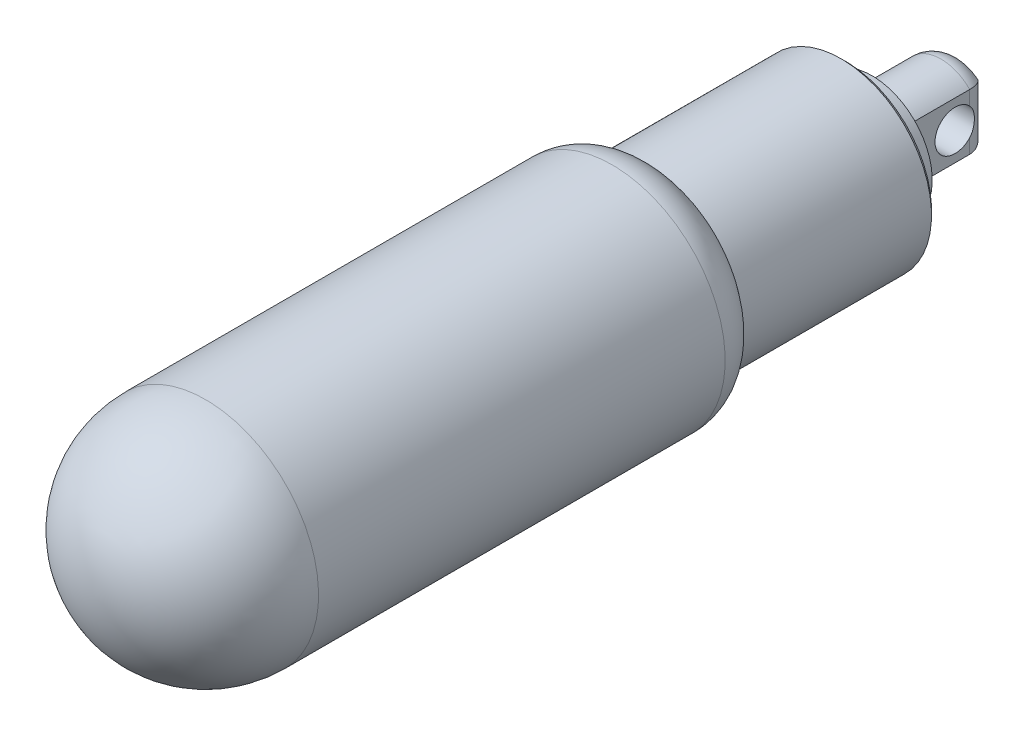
ISO-10303-21;
HEADER;
FILE_DESCRIPTION(('STEP AP214'),'2;1');
FILE_NAME('part.step','',(''),(''),'','','');
FILE_SCHEMA(('AUTOMOTIVE_DESIGN { 1 0 10303 214 1 1 1 1 }'));
ENDSEC;
DATA;
#1=APPLICATION_CONTEXT('core data for automotive mechanical design processes');
#2=APPLICATION_PROTOCOL_DEFINITION('international standard','automotive_design',2000,#1);
#3=PRODUCT_CONTEXT('',#1,'mechanical');
#4=PRODUCT('Part','Part','',(#3));
#5=PRODUCT_RELATED_PRODUCT_CATEGORY('part','',(#4));
#6=PRODUCT_DEFINITION_FORMATION('','',#4);
#7=PRODUCT_DEFINITION_CONTEXT('part definition',#1,'design');
#8=PRODUCT_DEFINITION('design','',#6,#7);
#9=PRODUCT_DEFINITION_SHAPE('','',#8);
#10=(LENGTH_UNIT() NAMED_UNIT(*) SI_UNIT(.MILLI.,.METRE.));
#11=(NAMED_UNIT(*) PLANE_ANGLE_UNIT() SI_UNIT($,.RADIAN.));
#12=(NAMED_UNIT(*) SI_UNIT($,.STERADIAN.) SOLID_ANGLE_UNIT());
#13=UNCERTAINTY_MEASURE_WITH_UNIT(LENGTH_MEASURE(1.E-05),#10,'distance_accuracy_value','');
#14=(GEOMETRIC_REPRESENTATION_CONTEXT(3) GLOBAL_UNCERTAINTY_ASSIGNED_CONTEXT((#13)) GLOBAL_UNIT_ASSIGNED_CONTEXT((#10,
#11,#12)) REPRESENTATION_CONTEXT('',''));
#15=CARTESIAN_POINT('',(0.,0.,0.));
#16=DIRECTION('',(0.,0.,1.));
#17=DIRECTION('',(1.,0.,0.));
#18=AXIS2_PLACEMENT_3D('',#15,#16,#17);
#19=CARTESIAN_POINT('',(0.685714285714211,9.,-1.16756756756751));
#20=DIRECTION('',(0.,-1.,0.));
#21=DIRECTION('',(1.,0.,0.));
#22=AXIS2_PLACEMENT_3D('',#19,#20,#21);
#23=CYLINDRICAL_SURFACE('',#22,1.60000000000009);
#24=CARTESIAN_POINT('',(2.2857142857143,-1.09397713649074,-1.16756756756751));
#25=CARTESIAN_POINT('',(2.28571208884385,-1.06141426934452,-1.1980795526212));
#26=CARTESIAN_POINT('',(2.28484202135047,-1.02759941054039,-1.22720226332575));
#27=CARTESIAN_POINT('',(2.28182220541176,-0.957711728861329,-1.28248689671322));
#28=CARTESIAN_POINT('',(2.27967317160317,-0.921640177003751,-1.30865046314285));
#29=CARTESIAN_POINT('',(2.27199328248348,-0.810412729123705,-1.3824381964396));
#30=CARTESIAN_POINT('',(2.26522815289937,-0.732190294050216,-1.42540959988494));
#31=CARTESIAN_POINT('',(2.25171233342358,-0.569818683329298,-1.49773470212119));
#32=CARTESIAN_POINT('',(2.24496163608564,-0.485674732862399,-1.5271002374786));
#33=CARTESIAN_POINT('',(2.23406179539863,-0.313560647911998,-1.57148376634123));
#34=CARTESIAN_POINT('',(2.22991047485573,-0.225593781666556,-1.58651377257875));
#35=CARTESIAN_POINT('',(2.22569691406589,-0.0481345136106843,-1.60175736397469));
#36=CARTESIAN_POINT('',(2.22564131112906,0.0413601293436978,-1.60194689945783));
#37=CARTESIAN_POINT('',(2.22965833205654,0.219094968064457,-1.58743597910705));
#38=CARTESIAN_POINT('',(2.2337338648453,0.307334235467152,-1.57272503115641));
#39=CARTESIAN_POINT('',(2.24441778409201,0.47805000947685,-1.52939923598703));
#40=CARTESIAN_POINT('',(2.25096842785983,0.560610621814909,-1.50109764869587));
#41=CARTESIAN_POINT('',(2.26419075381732,0.719970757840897,-1.43149699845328));
#42=CARTESIAN_POINT('',(2.27086227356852,0.796777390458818,-1.39021431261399));
#43=CARTESIAN_POINT('',(2.27891819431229,0.90961185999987,-1.3171431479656));
#44=CARTESIAN_POINT('',(2.28132806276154,0.948330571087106,-1.28954522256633));
#45=CARTESIAN_POINT('',(2.28472393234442,1.02316468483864,-1.23101155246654));
#46=CARTESIAN_POINT('',(2.28571119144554,1.05928236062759,-1.20007878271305));
#47=CARTESIAN_POINT('',(2.2857142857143,1.09397713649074,-1.16756756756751));
#48=B_SPLINE_CURVE_WITH_KNOTS('',3,(#24,#25,#26,#27,#28,#29,#30,#31,#32,#33,#34,#35,#36,#37,#38,
#39,#40,#41,#42,#43,#44,#45,#46,#47),.UNSPECIFIED.,.F.,.F.,(4,2,2,2,2,2,2,2,2,2,2,4),(0.,
0.133762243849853,0.267449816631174,0.534607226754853,0.801531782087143,1.06823246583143,
1.33536534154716,1.60268644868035,1.86412182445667,2.12522868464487,2.26786861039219,
2.4103823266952),.UNSPECIFIED.);
#49=CARTESIAN_POINT('',(2.2857142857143,-1.09397713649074,-1.16756756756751));
#50=VERTEX_POINT('',#49);
#51=CARTESIAN_POINT('',(2.2857142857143,1.09397713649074,-1.16756756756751));
#52=VERTEX_POINT('',#51);
#53=EDGE_CURVE('E34',#50,#52,#48,.T.);
#54=ORIENTED_EDGE('',*,*,#53,.F.);
#55=DIRECTION('',(0.,-1.,0.));
#56=VECTOR('',#55,1.);
#57=CARTESIAN_POINT('',(2.2857142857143,9.,-1.16756756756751));
#58=LINE('',#57,#56);
#59=CARTESIAN_POINT('',(2.2857142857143,-2.23953347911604,-1.16756756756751));
#60=VERTEX_POINT('',#59);
#61=EDGE_CURVE('E101',#50,#60,#58,.T.);
#62=ORIENTED_EDGE('',*,*,#61,.T.);
#63=CARTESIAN_POINT('',(2.2857142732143,-2.23953347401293,-1.1673675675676));
#64=CARTESIAN_POINT('',(2.28572083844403,-2.23953513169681,-1.20977671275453));
#65=CARTESIAN_POINT('',(2.28403753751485,-2.23884906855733,-1.25216508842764));
#66=CARTESIAN_POINT('',(2.2773220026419,-2.23610533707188,-1.33662417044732));
#67=CARTESIAN_POINT('',(2.27229031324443,-2.23404789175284,-1.37869492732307));
#68=CARTESIAN_POINT('',(2.2522611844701,-2.2258415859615,-1.50376789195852));
#69=CARTESIAN_POINT('',(2.23232926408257,-2.21765868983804,-1.58590781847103));
#70=CARTESIAN_POINT('',(2.18010699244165,-2.19602267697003,-1.74535595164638));
#71=CARTESIAN_POINT('',(2.14781758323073,-2.18256996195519,-1.82266452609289));
#72=CARTESIAN_POINT('',(2.07213485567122,-2.15063236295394,-1.97052128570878));
#73=CARTESIAN_POINT('',(2.02873894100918,-2.13214630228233,-2.04106788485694));
#74=CARTESIAN_POINT('',(1.93126685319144,-2.08993619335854,-2.17536255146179));
#75=CARTESIAN_POINT('',(1.87695657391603,-2.06609567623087,-2.23890351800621));
#76=CARTESIAN_POINT('',(1.76029577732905,-2.01380933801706,-2.35588703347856));
#77=CARTESIAN_POINT('',(1.69794350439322,-1.98536251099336,-2.40932737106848));
#78=CARTESIAN_POINT('',(1.56293039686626,-1.9222146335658,-2.50844683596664));
#79=CARTESIAN_POINT('',(1.48986136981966,-1.88722539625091,-2.55338493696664));
#80=CARTESIAN_POINT('',(1.33931523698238,-1.8128254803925,-2.63042895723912));
#81=CARTESIAN_POINT('',(1.26183524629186,-1.77341189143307,-2.66252636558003));
#82=CARTESIAN_POINT('',(1.10211068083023,-1.68909639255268,-2.71479842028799));
#83=CARTESIAN_POINT('',(1.01979425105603,-1.64405070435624,-2.73451661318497));
#84=CARTESIAN_POINT('',(0.855494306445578,-1.54998618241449,-2.7607016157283));
#85=CARTESIAN_POINT('',(0.773510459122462,-1.5009746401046,-2.76719219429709));
#86=CARTESIAN_POINT('',(0.690457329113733,-1.44861007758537,-2.76756231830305));
#87=CARTESIAN_POINT('',(0.688085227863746,-1.44711216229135,-2.76756758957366));
#88=CARTESIAN_POINT('',(0.685714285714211,-1.44561264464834,-2.7675675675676));
#89=B_SPLINE_CURVE_WITH_KNOTS('',3,(#63,#64,#65,#66,#67,#68,#69,#70,#71,#72,#73,#74,#75,#76,#77,
#78,#79,#80,#81,#82,#83,#84,#85,#86,#87,#88),.UNSPECIFIED.,.F.,.F.,(4,2,2,2,2,2,2,2,2,2,2,2,4),
(0.,0.127146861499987,0.254273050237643,0.507705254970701,0.761118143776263,1.01459032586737,
1.27422781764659,1.53392208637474,1.81068599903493,2.08763305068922,2.37427007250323,
2.66039157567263,2.66880794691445),.UNSPECIFIED.);
#90=CARTESIAN_POINT('',(0.685714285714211,-1.44561264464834,-2.7675675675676));
#91=VERTEX_POINT('',#90);
#92=EDGE_CURVE('E107',#60,#91,#89,.T.);
#93=ORIENTED_EDGE('',*,*,#92,.T.);
#94=DIRECTION('',(0.,-1.,0.));
#95=VECTOR('',#94,1.);
#96=CARTESIAN_POINT('',(0.685714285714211,9.,-2.7675675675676));
#97=LINE('',#96,#95);
#98=CARTESIAN_POINT('',(0.68571428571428,1.44561264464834,-2.7675675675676));
#99=VERTEX_POINT('',#98);
#100=EDGE_CURVE('E171',#91,#99,#97,.F.);
#101=ORIENTED_EDGE('',*,*,#100,.T.);
#102=CARTESIAN_POINT('',(0.685714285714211,1.44561264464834,-2.76756756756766));
#103=CARTESIAN_POINT('',(0.688085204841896,1.4471121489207,-2.76756759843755));
#104=CARTESIAN_POINT('',(0.690457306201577,1.44861006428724,-2.76756232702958));
#105=CARTESIAN_POINT('',(0.788694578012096,1.51054810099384,-2.76712417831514));
#106=CARTESIAN_POINT('',(0.886436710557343,1.56839009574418,-2.75802683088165));
#107=CARTESIAN_POINT('',(1.08182290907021,1.67843606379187,-2.72095830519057));
#108=CARTESIAN_POINT('',(1.17946605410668,1.73062493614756,-2.69293795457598));
#109=CARTESIAN_POINT('',(1.36836122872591,1.82766720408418,-2.61811568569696));
#110=CARTESIAN_POINT('',(1.45970404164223,1.87265080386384,-2.57171733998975));
#111=CARTESIAN_POINT('',(1.63382877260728,1.95581689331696,-2.46051939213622));
#112=CARTESIAN_POINT('',(1.71662128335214,1.99400784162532,-2.39574294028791));
#113=CARTESIAN_POINT('',(1.86079354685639,2.05899170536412,-2.25753014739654));
#114=CARTESIAN_POINT('',(1.92353439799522,2.08658355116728,-2.18588791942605));
#115=CARTESIAN_POINT('',(2.03606547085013,2.13532310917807,-2.03109985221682));
#116=CARTESIAN_POINT('',(2.08585937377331,2.15647265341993,-1.94795729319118));
#117=CARTESIAN_POINT('',(2.16616656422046,2.19024362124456,-1.78081809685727));
#118=CARTESIAN_POINT('',(2.19801832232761,2.2034642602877,-1.69758188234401));
#119=CARTESIAN_POINT('',(2.247499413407,2.2239014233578,-1.526359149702));
#120=CARTESIAN_POINT('',(2.26515551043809,2.23112924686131,-1.43838190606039));
#121=CARTESIAN_POINT('',(2.27879710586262,2.23670796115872,-1.31929495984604));
#122=CARTESIAN_POINT('',(2.28139486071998,2.23776945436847,-1.2889516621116));
#123=CARTESIAN_POINT('',(2.28485297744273,2.23918197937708,-1.22819958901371));
#124=CARTESIAN_POINT('',(2.28571617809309,2.2395341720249,-1.19779100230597));
#125=CARTESIAN_POINT('',(2.28571427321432,2.23953347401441,-1.16736756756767));
#126=B_SPLINE_CURVE_WITH_KNOTS('',3,(#102,#103,#104,#105,#106,#107,#108,#109,#110,#111,#112,
#113,#114,#115,#116,#117,#118,#119,#120,#121,#122,#123,#124,#125),.UNSPECIFIED.,.F.,.F.,(4,2,2,
2,2,2,2,2,2,2,2,4),(0.,0.00841637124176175,0.34838323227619,0.689236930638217,1.02298731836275,
1.35631914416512,1.65215044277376,1.94789753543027,2.21683918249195,2.48527257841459,
2.57664827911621,2.66787431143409),.UNSPECIFIED.);
#127=CARTESIAN_POINT('',(2.2857142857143,2.23953347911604,-1.16756756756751));
#128=VERTEX_POINT('',#127);
#129=EDGE_CURVE('E116',#99,#128,#126,.T.);
#130=ORIENTED_EDGE('',*,*,#129,.T.);
#131=EDGE_CURVE('E97',#128,#52,#58,.T.);
#132=ORIENTED_EDGE('',*,*,#131,.T.);
#133=EDGE_LOOP('',(#54,#62,#93,#101,#130,#132));
#134=FACE_BOUND('',#133,.T.);
#135=ADVANCED_FACE('F14',(#134),#23,.T.);
#136=CARTESIAN_POINT('',(-0.685714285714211,9.,-1.16756756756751));
#137=DIRECTION('',(0.,-1.,0.));
#138=DIRECTION('',(1.,0.,0.));
#139=AXIS2_PLACEMENT_3D('',#136,#137,#138);
#140=CYLINDRICAL_SURFACE('',#139,1.60000000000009);
#141=CARTESIAN_POINT('',(-2.2857142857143,1.09397713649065,-1.1675675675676));
#142=CARTESIAN_POINT('',(-2.28571208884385,1.06141426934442,-1.19807955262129));
#143=CARTESIAN_POINT('',(-2.28484202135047,1.02759941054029,-1.22720226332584));
#144=CARTESIAN_POINT('',(-2.28182220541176,0.957711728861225,-1.2824868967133));
#145=CARTESIAN_POINT('',(-2.27967317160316,0.921640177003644,-1.30865046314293));
#146=CARTESIAN_POINT('',(-2.27199328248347,0.810412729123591,-1.38243819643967));
#147=CARTESIAN_POINT('',(-2.26522815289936,0.732190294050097,-1.425409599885));
#148=CARTESIAN_POINT('',(-2.25171233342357,0.569818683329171,-1.49773470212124));
#149=CARTESIAN_POINT('',(-2.24496163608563,0.485674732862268,-1.52710023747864));
#150=CARTESIAN_POINT('',(-2.23406179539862,0.31356064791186,-1.57148376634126));
#151=CARTESIAN_POINT('',(-2.22991047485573,0.225593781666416,-1.58651377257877));
#152=CARTESIAN_POINT('',(-2.22569691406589,0.0481345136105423,-1.60175736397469));
#153=CARTESIAN_POINT('',(-2.22564131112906,-0.0413601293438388,-1.60194689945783));
#154=CARTESIAN_POINT('',(-2.22965833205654,-0.219094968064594,-1.58743597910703));
#155=CARTESIAN_POINT('',(-2.23373386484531,-0.307334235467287,-1.57272503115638));
#156=CARTESIAN_POINT('',(-2.24441778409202,-0.47805000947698,-1.52939923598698));
#157=CARTESIAN_POINT('',(-2.25096842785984,-0.560610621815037,-1.50109764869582));
#158=CARTESIAN_POINT('',(-2.26419075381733,-0.719970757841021,-1.43149699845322));
#159=CARTESIAN_POINT('',(-2.27086227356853,-0.796777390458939,-1.39021431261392));
#160=CARTESIAN_POINT('',(-2.2789181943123,-0.909611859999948,-1.31714314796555));
#161=CARTESIAN_POINT('',(-2.28132806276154,-0.948330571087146,-1.2895452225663));
#162=CARTESIAN_POINT('',(-2.28472393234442,-1.02316468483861,-1.23101155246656));
#163=CARTESIAN_POINT('',(-2.28571119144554,-1.05928236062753,-1.2000787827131));
#164=CARTESIAN_POINT('',(-2.2857142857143,-1.09397713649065,-1.1675675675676));
#165=B_SPLINE_CURVE_WITH_KNOTS('',3,(#141,#142,#143,#144,#145,#146,#147,#148,#149,#150,#151,
#152,#153,#154,#155,#156,#157,#158,#159,#160,#161,#162,#163,#164),.UNSPECIFIED.,.F.,.F.,(4,2,2,
2,2,2,2,2,2,2,2,4),(0.,0.133762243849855,0.267449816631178,0.534607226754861,0.801531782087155,
1.06823246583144,1.33536534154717,1.60268644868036,1.86412182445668,2.12522868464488,
2.26786861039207,2.41038232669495),.UNSPECIFIED.);
#166=CARTESIAN_POINT('',(-2.2857142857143,1.09397713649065,-1.1675675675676));
#167=VERTEX_POINT('',#166);
#168=CARTESIAN_POINT('',(-2.2857142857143,-1.09397713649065,-1.1675675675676));
#169=VERTEX_POINT('',#168);
#170=EDGE_CURVE('E9',#167,#169,#165,.T.);
#171=ORIENTED_EDGE('',*,*,#170,.F.);
#172=DIRECTION('',(0.,-1.,0.));
#173=VECTOR('',#172,1.);
#174=CARTESIAN_POINT('',(-2.2857142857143,9.,-1.1675675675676));
#175=LINE('',#174,#173);
#176=CARTESIAN_POINT('',(-2.2857142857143,2.23953347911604,-1.1675675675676));
#177=VERTEX_POINT('',#176);
#178=EDGE_CURVE('E90',#177,#167,#175,.T.);
#179=ORIENTED_EDGE('',*,*,#178,.F.);
#180=CARTESIAN_POINT('',(-2.2857142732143,2.23953347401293,-1.1673675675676));
#181=CARTESIAN_POINT('',(-2.28572083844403,2.23953513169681,-1.20977671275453));
#182=CARTESIAN_POINT('',(-2.28403753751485,2.23884906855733,-1.25216508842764));
#183=CARTESIAN_POINT('',(-2.2773220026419,2.23610533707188,-1.33662417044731));
#184=CARTESIAN_POINT('',(-2.27229031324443,2.23404789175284,-1.37869492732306));
#185=CARTESIAN_POINT('',(-2.2522611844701,2.2258415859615,-1.50376789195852));
#186=CARTESIAN_POINT('',(-2.23232926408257,2.21765868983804,-1.58590781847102));
#187=CARTESIAN_POINT('',(-2.18010699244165,2.19602267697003,-1.74535595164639));
#188=CARTESIAN_POINT('',(-2.14781758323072,2.18256996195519,-1.82266452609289));
#189=CARTESIAN_POINT('',(-2.07213485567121,2.15063236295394,-1.97052128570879));
#190=CARTESIAN_POINT('',(-2.02873894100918,2.13214630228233,-2.04106788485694));
#191=CARTESIAN_POINT('',(-1.93126685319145,2.08993619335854,-2.17536255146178));
#192=CARTESIAN_POINT('',(-1.87695657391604,2.06609567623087,-2.2389035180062));
#193=CARTESIAN_POINT('',(-1.76029577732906,2.01380933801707,-2.35588703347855));
#194=CARTESIAN_POINT('',(-1.69794350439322,1.98536251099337,-2.40932737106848));
#195=CARTESIAN_POINT('',(-1.56293039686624,1.92221463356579,-2.50844683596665));
#196=CARTESIAN_POINT('',(-1.48986136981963,1.88722539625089,-2.55338493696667));
#197=CARTESIAN_POINT('',(-1.33931523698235,1.81282548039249,-2.63042895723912));
#198=CARTESIAN_POINT('',(-1.26183524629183,1.77341189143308,-2.66252636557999));
#199=CARTESIAN_POINT('',(-1.10211068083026,1.68909639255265,-2.71479842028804));
#200=CARTESIAN_POINT('',(-1.01979425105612,1.64405070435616,-2.73451661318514));
#201=CARTESIAN_POINT('',(-0.855494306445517,1.54998618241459,-2.76070161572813));
#202=CARTESIAN_POINT('',(-0.7735104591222,1.50097464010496,-2.76719219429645));
#203=CARTESIAN_POINT('',(-0.690457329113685,1.44861007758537,-2.76756231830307));
#204=CARTESIAN_POINT('',(-0.688085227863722,1.44711216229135,-2.76756758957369));
#205=CARTESIAN_POINT('',(-0.685714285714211,1.44561264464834,-2.76756756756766));
#206=B_SPLINE_CURVE_WITH_KNOTS('',3,(#180,#181,#182,#183,#184,#185,#186,#187,#188,#189,#190,
#191,#192,#193,#194,#195,#196,#197,#198,#199,#200,#201,#202,#203,#204,#205),.UNSPECIFIED.,.F.,
.F.,(4,2,2,2,2,2,2,2,2,2,2,2,4),(0.,0.127146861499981,0.254273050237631,0.507705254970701,
0.761118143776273,1.01459032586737,1.27422781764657,1.53392208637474,1.81068599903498,
2.08763305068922,2.3742700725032,2.66039157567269,2.66880794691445),.UNSPECIFIED.);
#207=CARTESIAN_POINT('',(-0.685714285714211,1.44561264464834,-2.7675675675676));
#208=VERTEX_POINT('',#207);
#209=EDGE_CURVE('E215',#177,#208,#206,.T.);
#210=ORIENTED_EDGE('',*,*,#209,.T.);
#211=DIRECTION('',(0.,-1.,0.));
#212=VECTOR('',#211,1.);
#213=CARTESIAN_POINT('',(-0.685714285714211,9.,-2.7675675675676));
#214=LINE('',#213,#212);
#215=CARTESIAN_POINT('',(-0.685714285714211,-1.44561264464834,-2.7675675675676));
#216=VERTEX_POINT('',#215);
#217=EDGE_CURVE('E28',#216,#208,#214,.F.);
#218=ORIENTED_EDGE('',*,*,#217,.F.);
#219=CARTESIAN_POINT('',(-0.685714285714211,-1.44561264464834,-2.7675675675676));
#220=CARTESIAN_POINT('',(-0.688085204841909,-1.44711214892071,-2.76756759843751));
#221=CARTESIAN_POINT('',(-0.690457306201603,-1.44861006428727,-2.76756232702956));
#222=CARTESIAN_POINT('',(-0.788694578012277,-1.5105481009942,-2.76712417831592));
#223=CARTESIAN_POINT('',(-0.886436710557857,-1.56839009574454,-2.75802683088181));
#224=CARTESIAN_POINT('',(-1.08182290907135,-1.67843606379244,-2.7209583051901));
#225=CARTESIAN_POINT('',(-1.17946605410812,-1.73062493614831,-2.69293795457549));
#226=CARTESIAN_POINT('',(-1.36836122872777,-1.82766720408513,-2.61811568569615));
#227=CARTESIAN_POINT('',(-1.45970404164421,-1.87265080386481,-2.57171733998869));
#228=CARTESIAN_POINT('',(-1.63382877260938,-1.95581689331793,-2.46051939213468));
#229=CARTESIAN_POINT('',(-1.71662128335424,-1.99400784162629,-2.39574294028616));
#230=CARTESIAN_POINT('',(-1.86079354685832,-2.05899170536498,-2.25753014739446));
#231=CARTESIAN_POINT('',(-1.923534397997,-2.08658355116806,-2.18588791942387));
#232=CARTESIAN_POINT('',(-2.03606547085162,-2.13532310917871,-2.03109985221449));
#233=CARTESIAN_POINT('',(-2.08585937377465,-2.1564726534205,-1.94795729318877));
#234=CARTESIAN_POINT('',(-2.1661665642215,-2.19024362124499,-1.78081809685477));
#235=CARTESIAN_POINT('',(-2.1980183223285,-2.20346426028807,-1.69758188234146));
#236=CARTESIAN_POINT('',(-2.24749941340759,-2.22390142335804,-1.52635914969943));
#237=CARTESIAN_POINT('',(-2.26515551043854,-2.23112924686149,-1.43838190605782));
#238=CARTESIAN_POINT('',(-2.27879710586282,-2.2367079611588,-1.31929495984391));
#239=CARTESIAN_POINT('',(-2.2813948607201,-2.23776945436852,-1.28895166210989));
#240=CARTESIAN_POINT('',(-2.28485297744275,-2.23918197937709,-1.22819958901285));
#241=CARTESIAN_POINT('',(-2.28571617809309,-2.2395341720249,-1.19779100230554));
#242=CARTESIAN_POINT('',(-2.28571427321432,-2.23953347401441,-1.16736756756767));
#243=B_SPLINE_CURVE_WITH_KNOTS('',3,(#219,#220,#221,#222,#223,#224,#225,#226,#227,#228,#229,
#230,#231,#232,#233,#234,#235,#236,#237,#238,#239,#240,#241,#242),.UNSPECIFIED.,.F.,.F.,(4,2,2,
2,2,2,2,2,2,2,2,4),(0.,0.0084163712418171,0.348383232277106,0.689236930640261,1.02298731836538,
1.35631914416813,1.65215044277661,1.94789753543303,2.21683918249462,2.48527257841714,
2.57664827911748,2.66787431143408),.UNSPECIFIED.);
#244=CARTESIAN_POINT('',(-2.2857142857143,-2.23953347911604,-1.1675675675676));
#245=VERTEX_POINT('',#244);
#246=EDGE_CURVE('E95',#216,#245,#243,.T.);
#247=ORIENTED_EDGE('',*,*,#246,.T.);
#248=EDGE_CURVE('E88',#169,#245,#175,.T.);
#249=ORIENTED_EDGE('',*,*,#248,.F.);
#250=EDGE_LOOP('',(#171,#179,#210,#218,#247,#249));
#251=FACE_BOUND('',#250,.T.);
#252=ADVANCED_FACE('F93',(#251),#140,.T.);
#253=CARTESIAN_POINT('',(0.,0.,-2.7675675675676));
#254=DIRECTION('',(0.,0.,-1.));
#255=DIRECTION('',(-1.,0.,0.));
#256=AXIS2_PLACEMENT_3D('',#253,#254,#255);
#257=CYLINDRICAL_SURFACE('',#256,3.2);
#258=DIRECTION('',(0.,0.,-1.));
#259=VECTOR('',#258,1.);
#260=CARTESIAN_POINT('',(-2.2857142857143,2.23953347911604,-2.7675675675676));
#261=LINE('',#260,#259);
#262=CARTESIAN_POINT('',(-2.2857142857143,2.23953347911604,4.3324324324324));
#263=VERTEX_POINT('',#262);
#264=EDGE_CURVE('E180',#263,#177,#261,.T.);
#265=ORIENTED_EDGE('',*,*,#264,.F.);
#266=CARTESIAN_POINT('',(0.,0.,4.3324324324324));
#267=DIRECTION('',(0.,0.,-1.));
#268=DIRECTION('',(-1.,0.,0.));
#269=AXIS2_PLACEMENT_3D('',#266,#267,#268);
#270=CIRCLE('',#269,3.2);
#271=CARTESIAN_POINT('',(2.2857142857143,2.23953347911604,4.3324324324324));
#272=VERTEX_POINT('',#271);
#273=EDGE_CURVE('E185',#263,#272,#270,.T.);
#274=ORIENTED_EDGE('',*,*,#273,.T.);
#275=DIRECTION('',(0.,0.,-1.));
#276=VECTOR('',#275,1.);
#277=CARTESIAN_POINT('',(2.2857142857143,2.23953347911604,-2.7675675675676));
#278=LINE('',#277,#276);
#279=EDGE_CURVE('E216',#128,#272,#278,.F.);
#280=ORIENTED_EDGE('',*,*,#279,.F.);
#281=CARTESIAN_POINT('',(0.,0.,-1.1675675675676));
#282=DIRECTION('',(0.,0.,-1.));
#283=DIRECTION('',(-1.,0.,0.));
#284=AXIS2_PLACEMENT_3D('',#281,#282,#283);
#285=CIRCLE('',#284,3.2);
#286=EDGE_CURVE('E174',#177,#128,#285,.T.);
#287=ORIENTED_EDGE('',*,*,#286,.F.);
#288=EDGE_LOOP('',(#265,#274,#280,#287));
#289=FACE_BOUND('',#288,.T.);
#290=ADVANCED_FACE('F236',(#289),#257,.T.);
#291=DIRECTION('',(0.,0.,-1.));
#292=VECTOR('',#291,1.);
#293=CARTESIAN_POINT('',(2.2857142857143,-2.23953347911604,-2.7675675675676));
#294=LINE('',#293,#292);
#295=CARTESIAN_POINT('',(2.2857142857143,-2.23953347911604,4.3324324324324));
#296=VERTEX_POINT('',#295);
#297=EDGE_CURVE('E228',#296,#60,#294,.T.);
#298=ORIENTED_EDGE('',*,*,#297,.F.);
#299=CARTESIAN_POINT('',(-2.2857142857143,-2.23953347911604,4.3324324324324));
#300=VERTEX_POINT('',#299);
#301=EDGE_CURVE('E186',#296,#300,#270,.T.);
#302=ORIENTED_EDGE('',*,*,#301,.T.);
#303=DIRECTION('',(0.,0.,-1.));
#304=VECTOR('',#303,1.);
#305=CARTESIAN_POINT('',(-2.2857142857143,-2.23953347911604,-2.7675675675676));
#306=LINE('',#305,#304);
#307=EDGE_CURVE('E230',#245,#300,#306,.F.);
#308=ORIENTED_EDGE('',*,*,#307,.F.);
#309=EDGE_CURVE('E178',#60,#245,#285,.T.);
#310=ORIENTED_EDGE('',*,*,#309,.F.);
#311=EDGE_LOOP('',(#298,#302,#308,#310));
#312=FACE_BOUND('',#311,.T.);
#313=ADVANCED_FACE('F163',(#312),#257,.T.);
#314=CARTESIAN_POINT('',(0.,0.,-1.16756756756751));
#315=DIRECTION('',(0.,0.,-1.));
#316=DIRECTION('',(-1.,0.,0.));
#317=AXIS2_PLACEMENT_3D('',#314,#315,#316);
#318=DEGENERATE_TOROIDAL_SURFACE('',#317,1.59999999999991,1.60000000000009,.T.);
#319=ORIENTED_EDGE('',*,*,#209,.F.);
#320=ORIENTED_EDGE('',*,*,#286,.T.);
#321=ORIENTED_EDGE('',*,*,#129,.F.);
#322=CARTESIAN_POINT('',(0.,0.,-2.7675675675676));
#323=DIRECTION('',(0.,0.,-1.));
#324=DIRECTION('',(-1.,0.,0.));
#325=AXIS2_PLACEMENT_3D('',#322,#323,#324);
#326=CIRCLE('',#325,1.59999999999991);
#327=EDGE_CURVE('E175',#208,#99,#326,.T.);
#328=ORIENTED_EDGE('',*,*,#327,.F.);
#329=EDGE_LOOP('',(#319,#320,#321,#328));
#330=FACE_BOUND('',#329,.T.);
#331=ADVANCED_FACE('F155',(#330),#318,.T.);
#332=CARTESIAN_POINT('',(0.,-1.6,-2.7675675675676));
#333=DIRECTION('',(0.,0.,1.));
#334=DIRECTION('',(1.,0.,0.));
#335=AXIS2_PLACEMENT_3D('',#332,#333,#334);
#336=PLANE('',#335);
#337=EDGE_CURVE('E168',#91,#216,#326,.T.);
#338=ORIENTED_EDGE('',*,*,#337,.T.);
#339=ORIENTED_EDGE('',*,*,#217,.T.);
#340=ORIENTED_EDGE('',*,*,#327,.T.);
#341=ORIENTED_EDGE('',*,*,#100,.F.);
#342=EDGE_LOOP('',(#338,#339,#340,#341));
#343=FACE_BOUND('',#342,.T.);
#344=ADVANCED_FACE('F153',(#343),#336,.F.);
#345=CARTESIAN_POINT('',(0.,0.,57.4324324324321));
#346=DIRECTION('',(0.,0.,-1.));
#347=DIRECTION('',(0.,-1.,0.));
#348=AXIS2_PLACEMENT_3D('',#345,#346,#347);
#349=SPHERICAL_SURFACE('',#348,9.);
#350=CARTESIAN_POINT('',(0.,0.,57.4324324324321));
#351=DIRECTION('',(0.,0.,-1.));
#352=DIRECTION('',(-1.,0.,0.));
#353=AXIS2_PLACEMENT_3D('',#350,#351,#352);
#354=CIRCLE('',#353,9.);
#355=CARTESIAN_POINT('',(-9.,0.,57.4324324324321));
#356=VERTEX_POINT('',#355);
#357=EDGE_CURVE('E207',#356,#356,#354,.T.);
#358=ORIENTED_EDGE('',*,*,#357,.F.);
#359=EDGE_LOOP('',(#358));
#360=FACE_BOUND('',#359,.T.);
#361=ADVANCED_FACE('F16',(#360),#349,.T.);
#362=CARTESIAN_POINT('',(0.,0.,-2.7675675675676));
#363=DIRECTION('',(0.,0.,-1.));
#364=DIRECTION('',(-1.,0.,0.));
#365=AXIS2_PLACEMENT_3D('',#362,#363,#364);
#366=CYLINDRICAL_SURFACE('',#365,9.);
#367=CARTESIAN_POINT('',(0.,0.,25.032432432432));
#368=DIRECTION('',(0.,0.,-1.));
#369=DIRECTION('',(-1.,0.,0.));
#370=AXIS2_PLACEMENT_3D('',#367,#368,#369);
#371=CIRCLE('',#370,9.);
#372=CARTESIAN_POINT('',(-9.,0.,25.032432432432));
#373=VERTEX_POINT('',#372);
#374=EDGE_CURVE('E204',#373,#373,#371,.T.);
#375=ORIENTED_EDGE('',*,*,#374,.F.);
#376=EDGE_LOOP('',(#375));
#377=FACE_BOUND('',#376,.T.);
#378=ORIENTED_EDGE('',*,*,#357,.T.);
#379=EDGE_LOOP('',(#378));
#380=FACE_BOUND('',#379,.T.);
#381=ADVANCED_FACE('F161',(#377,#380),#366,.T.);
#382=CARTESIAN_POINT('',(0.,0.,25.0324324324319));
#383=DIRECTION('',(0.,0.,-1.));
#384=DIRECTION('',(-1.,0.,0.));
#385=AXIS2_PLACEMENT_3D('',#382,#383,#384);
#386=TOROIDAL_SURFACE('',#385,5.4,3.6);
#387=ORIENTED_EDGE('',*,*,#374,.T.);
#388=EDGE_LOOP('',(#387));
#389=FACE_BOUND('',#388,.T.);
#390=CARTESIAN_POINT('',(0.,0.,21.914740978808));
#391=DIRECTION('',(0.,0.,-1.));
#392=DIRECTION('',(-1.,0.,0.));
#393=AXIS2_PLACEMENT_3D('',#390,#391,#392);
#394=CIRCLE('',#393,7.2);
#395=CARTESIAN_POINT('',(-7.2,0.,21.914740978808));
#396=VERTEX_POINT('',#395);
#397=EDGE_CURVE('E201',#396,#396,#394,.T.);
#398=ORIENTED_EDGE('',*,*,#397,.F.);
#399=EDGE_LOOP('',(#398));
#400=FACE_BOUND('',#399,.T.);
#401=ADVANCED_FACE('F267',(#389,#400),#386,.T.);
#402=CARTESIAN_POINT('',(0.,0.,-2.7675675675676));
#403=DIRECTION('',(0.,0.,-1.));
#404=DIRECTION('',(-1.,0.,0.));
#405=AXIS2_PLACEMENT_3D('',#402,#403,#404);
#406=CYLINDRICAL_SURFACE('',#405,7.2);
#407=CARTESIAN_POINT('',(0.,0.,6.7924324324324));
#408=DIRECTION('',(0.,0.,-1.));
#409=DIRECTION('',(-1.,0.,0.));
#410=AXIS2_PLACEMENT_3D('',#407,#408,#409);
#411=CIRCLE('',#410,7.2);
#412=CARTESIAN_POINT('',(-7.2,0.,6.7924324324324));
#413=VERTEX_POINT('',#412);
#414=EDGE_CURVE('E198',#413,#413,#411,.T.);
#415=ORIENTED_EDGE('',*,*,#414,.F.);
#416=EDGE_LOOP('',(#415));
#417=FACE_BOUND('',#416,.T.);
#418=ORIENTED_EDGE('',*,*,#397,.T.);
#419=EDGE_LOOP('',(#418));
#420=FACE_BOUND('',#419,.T.);
#421=ADVANCED_FACE('F263',(#417,#420),#406,.T.);
#422=CARTESIAN_POINT('',(0.,0.,6.7924324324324));
#423=DIRECTION('',(0.,0.,1.));
#424=DIRECTION('',(1.,0.,0.));
#425=AXIS2_PLACEMENT_3D('',#422,#423,#424);
#426=CONICAL_SURFACE('',#425,7.2,0.785398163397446);
#427=CARTESIAN_POINT('',(0.,0.,6.4324324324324));
#428=DIRECTION('',(0.,0.,-1.));
#429=DIRECTION('',(-1.,0.,0.));
#430=AXIS2_PLACEMENT_3D('',#427,#428,#429);
#431=CIRCLE('',#430,6.84);
#432=CARTESIAN_POINT('',(-6.84,0.,6.4324324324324));
#433=VERTEX_POINT('',#432);
#434=EDGE_CURVE('E195',#433,#433,#431,.T.);
#435=ORIENTED_EDGE('',*,*,#434,.F.);
#436=EDGE_LOOP('',(#435));
#437=FACE_BOUND('',#436,.T.);
#438=ORIENTED_EDGE('',*,*,#414,.T.);
#439=EDGE_LOOP('',(#438));
#440=FACE_BOUND('',#439,.T.);
#441=ADVANCED_FACE('F259',(#437,#440),#426,.T.);
#442=CARTESIAN_POINT('',(0.,-6.84,6.4324324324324));
#443=DIRECTION('',(0.,0.,1.));
#444=DIRECTION('',(1.,0.,0.));
#445=AXIS2_PLACEMENT_3D('',#442,#443,#444);
#446=PLANE('',#445);
#447=CARTESIAN_POINT('',(0.,0.,6.4324324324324));
#448=DIRECTION('',(0.,0.,-1.));
#449=DIRECTION('',(-1.,0.,0.));
#450=AXIS2_PLACEMENT_3D('',#447,#448,#449);
#451=CIRCLE('',#450,5.095135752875);
#452=CARTESIAN_POINT('',(-5.095135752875,0.,6.4324324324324));
#453=VERTEX_POINT('',#452);
#454=EDGE_CURVE('E192',#453,#453,#451,.T.);
#455=ORIENTED_EDGE('',*,*,#454,.F.);
#456=EDGE_LOOP('',(#455));
#457=FACE_BOUND('',#456,.T.);
#458=ORIENTED_EDGE('',*,*,#434,.T.);
#459=EDGE_LOOP('',(#458));
#460=FACE_BOUND('',#459,.T.);
#461=ADVANCED_FACE('F255',(#457,#460),#446,.F.);
#462=CARTESIAN_POINT('',(0.,0.,6.4324324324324));
#463=DIRECTION('',(0.,0.,1.));
#464=DIRECTION('',(1.,0.,0.));
#465=AXIS2_PLACEMENT_3D('',#462,#463,#464);
#466=CONICAL_SURFACE('',#465,5.095135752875,0.139626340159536);
#467=CARTESIAN_POINT('',(0.,0.,4.3324324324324));
#468=DIRECTION('',(0.,0.,-1.));
#469=DIRECTION('',(-1.,0.,0.));
#470=AXIS2_PLACEMENT_3D('',#467,#468,#469);
#471=CIRCLE('',#470,4.8);
#472=CARTESIAN_POINT('',(-4.8,0.,4.3324324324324));
#473=VERTEX_POINT('',#472);
#474=EDGE_CURVE('E189',#473,#473,#471,.T.);
#475=ORIENTED_EDGE('',*,*,#474,.F.);
#476=EDGE_LOOP('',(#475));
#477=FACE_BOUND('',#476,.T.);
#478=ORIENTED_EDGE('',*,*,#454,.T.);
#479=EDGE_LOOP('',(#478));
#480=FACE_BOUND('',#479,.T.);
#481=ADVANCED_FACE('F252',(#477,#480),#466,.T.);
#482=CARTESIAN_POINT('',(0.,-4.8,4.3324324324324));
#483=DIRECTION('',(0.,0.,1.));
#484=DIRECTION('',(1.,0.,0.));
#485=AXIS2_PLACEMENT_3D('',#482,#483,#484);
#486=PLANE('',#485);
#487=ORIENTED_EDGE('',*,*,#301,.F.);
#488=DIRECTION('',(0.,-1.,0.));
#489=VECTOR('',#488,1.);
#490=CARTESIAN_POINT('',(2.2857142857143,9.,4.3324324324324));
#491=LINE('',#490,#489);
#492=EDGE_CURVE('E141',#272,#296,#491,.T.);
#493=ORIENTED_EDGE('',*,*,#492,.F.);
#494=ORIENTED_EDGE('',*,*,#273,.F.);
#495=DIRECTION('',(0.,-1.,0.));
#496=VECTOR('',#495,1.);
#497=CARTESIAN_POINT('',(-2.2857142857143,9.,4.3324324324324));
#498=LINE('',#497,#496);
#499=EDGE_CURVE('E99',#263,#300,#498,.T.);
#500=ORIENTED_EDGE('',*,*,#499,.T.);
#501=EDGE_LOOP('',(#487,#493,#494,#500));
#502=FACE_BOUND('',#501,.T.);
#503=ORIENTED_EDGE('',*,*,#474,.T.);
#504=EDGE_LOOP('',(#503));
#505=FACE_BOUND('',#504,.T.);
#506=ADVANCED_FACE('F242',(#502,#505),#486,.F.);
#507=ORIENTED_EDGE('',*,*,#92,.F.);
#508=ORIENTED_EDGE('',*,*,#309,.T.);
#509=ORIENTED_EDGE('',*,*,#246,.F.);
#510=ORIENTED_EDGE('',*,*,#337,.F.);
#511=EDGE_LOOP('',(#507,#508,#509,#510));
#512=FACE_BOUND('',#511,.T.);
#513=ADVANCED_FACE('F122',(#512),#318,.T.);
#514=CARTESIAN_POINT('',(2.2857142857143,9.,-1.1675675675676));
#515=DIRECTION('',(1.,0.,0.));
#516=DIRECTION('',(0.,0.,-1.));
#517=AXIS2_PLACEMENT_3D('',#514,#515,#516);
#518=PLANE('',#517);
#519=ORIENTED_EDGE('',*,*,#61,.F.);
#520=CARTESIAN_POINT('',(2.2857142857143,0.,0.));
#521=DIRECTION('',(1.,0.,0.));
#522=DIRECTION('',(0.,0.,-1.));
#523=AXIS2_PLACEMENT_3D('',#520,#521,#522);
#524=CIRCLE('',#523,1.6);
#525=EDGE_CURVE('E91',#50,#52,#524,.F.);
#526=ORIENTED_EDGE('',*,*,#525,.T.);
#527=ORIENTED_EDGE('',*,*,#131,.F.);
#528=ORIENTED_EDGE('',*,*,#279,.T.);
#529=ORIENTED_EDGE('',*,*,#492,.T.);
#530=ORIENTED_EDGE('',*,*,#297,.T.);
#531=EDGE_LOOP('',(#519,#526,#527,#528,#529,#530));
#532=FACE_BOUND('',#531,.T.);
#533=ADVANCED_FACE('F130',(#532),#518,.T.);
#534=CARTESIAN_POINT('',(-2.2857142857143,9.,4.3324324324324));
#535=DIRECTION('',(-1.,0.,0.));
#536=DIRECTION('',(0.,0.,1.));
#537=AXIS2_PLACEMENT_3D('',#534,#535,#536);
#538=PLANE('',#537);
#539=ORIENTED_EDGE('',*,*,#178,.T.);
#540=CARTESIAN_POINT('',(-2.2857142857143,0.,0.));
#541=DIRECTION('',(-1.,0.,0.));
#542=DIRECTION('',(0.,0.,1.));
#543=AXIS2_PLACEMENT_3D('',#540,#541,#542);
#544=CIRCLE('',#543,1.6);
#545=EDGE_CURVE('E40',#167,#169,#544,.F.);
#546=ORIENTED_EDGE('',*,*,#545,.T.);
#547=ORIENTED_EDGE('',*,*,#248,.T.);
#548=ORIENTED_EDGE('',*,*,#307,.T.);
#549=ORIENTED_EDGE('',*,*,#499,.F.);
#550=ORIENTED_EDGE('',*,*,#264,.T.);
#551=EDGE_LOOP('',(#539,#546,#547,#548,#549,#550));
#552=FACE_BOUND('',#551,.T.);
#553=ADVANCED_FACE('F87',(#552),#538,.T.);
#554=CARTESIAN_POINT('',(-9.,0.,0.));
#555=DIRECTION('',(1.,0.,0.));
#556=DIRECTION('',(0.,0.,-1.));
#557=AXIS2_PLACEMENT_3D('',#554,#555,#556);
#558=CYLINDRICAL_SURFACE('',#557,1.6);
#559=ORIENTED_EDGE('',*,*,#170,.T.);
#560=ORIENTED_EDGE('',*,*,#545,.F.);
#561=EDGE_LOOP('',(#559,#560));
#562=FACE_BOUND('',#561,.T.);
#563=ORIENTED_EDGE('',*,*,#53,.T.);
#564=ORIENTED_EDGE('',*,*,#525,.F.);
#565=EDGE_LOOP('',(#563,#564));
#566=FACE_BOUND('',#565,.T.);
#567=ADVANCED_FACE('F81',(#562,#566),#558,.F.);
#568=CLOSED_SHELL('',(#135,#252,#290,#313,#331,#344,#361,#381,#401,#421,#441,#461,#481,#506,
#513,#533,#553,#567));
#569=MANIFOLD_SOLID_BREP('B1',#568);
#570=ADVANCED_BREP_SHAPE_REPRESENTATION('',(#18,#569),#14);
#571=SHAPE_DEFINITION_REPRESENTATION(#9,#570);
ENDSEC;
END-ISO-10303-21;
